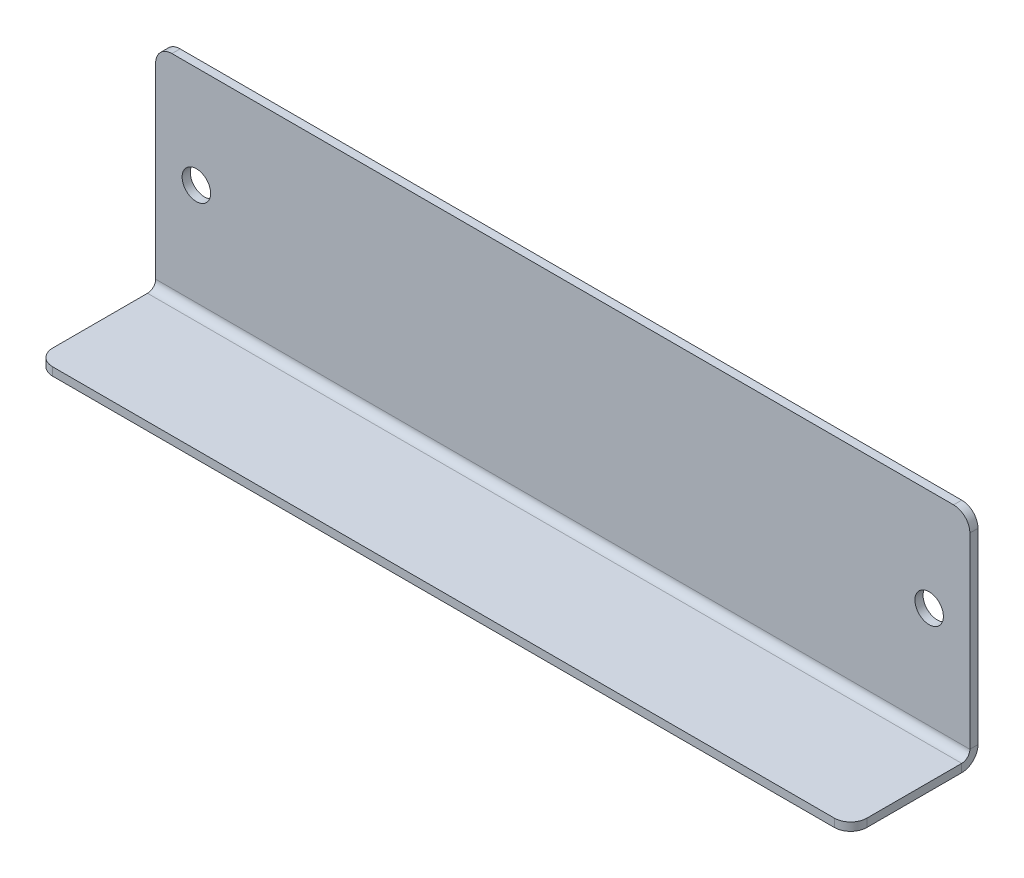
ISO-10303-21;
HEADER;
FILE_DESCRIPTION(('STEP AP214'),'2;1');
FILE_NAME('part.step','',(''),(''),'','','');
FILE_SCHEMA(('AUTOMOTIVE_DESIGN { 1 0 10303 214 1 1 1 1 }'));
ENDSEC;
DATA;
#1=APPLICATION_CONTEXT('core data for automotive mechanical design processes');
#2=APPLICATION_PROTOCOL_DEFINITION('international standard','automotive_design',2000,#1);
#3=PRODUCT_CONTEXT('',#1,'mechanical');
#4=PRODUCT('Part','Part','',(#3));
#5=PRODUCT_RELATED_PRODUCT_CATEGORY('part','',(#4));
#6=PRODUCT_DEFINITION_FORMATION('','',#4);
#7=PRODUCT_DEFINITION_CONTEXT('part definition',#1,'design');
#8=PRODUCT_DEFINITION('design','',#6,#7);
#9=PRODUCT_DEFINITION_SHAPE('','',#8);
#10=(LENGTH_UNIT() NAMED_UNIT(*) SI_UNIT(.MILLI.,.METRE.));
#11=(NAMED_UNIT(*) PLANE_ANGLE_UNIT() SI_UNIT($,.RADIAN.));
#12=(NAMED_UNIT(*) SI_UNIT($,.STERADIAN.) SOLID_ANGLE_UNIT());
#13=UNCERTAINTY_MEASURE_WITH_UNIT(LENGTH_MEASURE(1.E-05),#10,'distance_accuracy_value','');
#14=(GEOMETRIC_REPRESENTATION_CONTEXT(3) GLOBAL_UNCERTAINTY_ASSIGNED_CONTEXT((#13)) GLOBAL_UNIT_ASSIGNED_CONTEXT((#10,
#11,#12)) REPRESENTATION_CONTEXT('',''));
#15=CARTESIAN_POINT('',(0.,0.,0.));
#16=DIRECTION('',(0.,0.,1.));
#17=DIRECTION('',(1.,0.,0.));
#18=AXIS2_PLACEMENT_3D('',#15,#16,#17);
#19=CARTESIAN_POINT('',(50.,-26.9999999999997,-24.3561944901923));
#20=DIRECTION('',(1.,0.,0.));
#21=DIRECTION('',(0.,0.,-1.));
#22=AXIS2_PLACEMENT_3D('',#19,#20,#21);
#23=PLANE('',#22);
#24=DIRECTION('',(0.,0.,-1.));
#25=VECTOR('',#24,1.);
#26=CARTESIAN_POINT('',(50.,-26.9999999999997,-24.3561944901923));
#27=LINE('',#26,#25);
#28=CARTESIAN_POINT('',(50.,-26.9999999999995,12.6438055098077));
#29=VERTEX_POINT('',#28);
#30=CARTESIAN_POINT('',(50.,-26.9999999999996,1.));
#31=VERTEX_POINT('',#30);
#32=EDGE_CURVE('E254',#29,#31,#27,.T.);
#33=ORIENTED_EDGE('',*,*,#32,.T.);
#34=DIRECTION('',(0.,1.,0.));
#35=VECTOR('',#34,1.);
#36=CARTESIAN_POINT('',(50.,-26.9999999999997,1.));
#37=LINE('',#36,#35);
#38=CARTESIAN_POINT('',(50.,-25.9999999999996,1.));
#39=VERTEX_POINT('',#38);
#40=EDGE_CURVE('E14',#31,#39,#37,.T.);
#41=ORIENTED_EDGE('',*,*,#40,.T.);
#42=DIRECTION('',(0.,0.,-1.));
#43=VECTOR('',#42,1.);
#44=CARTESIAN_POINT('',(50.,-25.9999999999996,-24.3561944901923));
#45=LINE('',#44,#43);
#46=CARTESIAN_POINT('',(50.,-25.9999999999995,12.6438055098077));
#47=VERTEX_POINT('',#46);
#48=EDGE_CURVE('E77',#47,#39,#45,.T.);
#49=ORIENTED_EDGE('',*,*,#48,.F.);
#50=DIRECTION('',(0.,1.,0.));
#51=VECTOR('',#50,1.);
#52=CARTESIAN_POINT('',(50.,-26.9999999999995,12.6438055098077));
#53=LINE('',#52,#51);
#54=EDGE_CURVE('E176',#29,#47,#53,.T.);
#55=ORIENTED_EDGE('',*,*,#54,.F.);
#56=EDGE_LOOP('',(#33,#41,#49,#55));
#57=FACE_BOUND('',#56,.T.);
#58=ADVANCED_FACE('F61',(#57),#23,.T.);
#59=CARTESIAN_POINT('',(-50.0000000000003,-27.0000000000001,-24.3561944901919));
#60=DIRECTION('',(-1.,0.,0.));
#61=DIRECTION('',(0.,0.,1.));
#62=AXIS2_PLACEMENT_3D('',#59,#60,#61);
#63=PLANE('',#62);
#64=DIRECTION('',(0.,0.,1.));
#65=VECTOR('',#64,1.);
#66=CARTESIAN_POINT('',(-50.0000000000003,-26.,-24.3561944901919));
#67=LINE('',#66,#65);
#68=CARTESIAN_POINT('',(-50.0000000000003,-26.,1.00000000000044));
#69=VERTEX_POINT('',#68);
#70=CARTESIAN_POINT('',(-50.0000000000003,-25.9999999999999,12.6438055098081));
#71=VERTEX_POINT('',#70);
#72=EDGE_CURVE('E84',#69,#71,#67,.T.);
#73=ORIENTED_EDGE('',*,*,#72,.F.);
#74=DIRECTION('',(0.,-1.,0.));
#75=VECTOR('',#74,1.);
#76=CARTESIAN_POINT('',(-50.0000000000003,-27.0000000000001,1.00000000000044));
#77=LINE('',#76,#75);
#78=CARTESIAN_POINT('',(-50.0000000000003,-27.,1.00000000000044));
#79=VERTEX_POINT('',#78);
#80=EDGE_CURVE('E149',#69,#79,#77,.T.);
#81=ORIENTED_EDGE('',*,*,#80,.T.);
#82=DIRECTION('',(0.,0.,1.));
#83=VECTOR('',#82,1.);
#84=CARTESIAN_POINT('',(-50.0000000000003,-27.0000000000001,-24.3561944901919));
#85=LINE('',#84,#83);
#86=CARTESIAN_POINT('',(-50.0000000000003,-26.9999999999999,12.6438055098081));
#87=VERTEX_POINT('',#86);
#88=EDGE_CURVE('E64',#79,#87,#85,.T.);
#89=ORIENTED_EDGE('',*,*,#88,.T.);
#90=DIRECTION('',(0.,1.,0.));
#91=VECTOR('',#90,1.);
#92=CARTESIAN_POINT('',(-50.0000000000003,-26.9999999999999,12.6438055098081));
#93=LINE('',#92,#91);
#94=EDGE_CURVE('E268',#87,#71,#93,.T.);
#95=ORIENTED_EDGE('',*,*,#94,.T.);
#96=EDGE_LOOP('',(#73,#81,#89,#95));
#97=FACE_BOUND('',#96,.T.);
#98=ADVANCED_FACE('F151',(#97),#63,.T.);
#99=CARTESIAN_POINT('',(48.,-25.9999999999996,-24.3561944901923));
#100=DIRECTION('',(0.,1.,0.));
#101=DIRECTION('',(1.,0.,0.));
#102=AXIS2_PLACEMENT_3D('',#99,#100,#101);
#103=PLANE('',#102);
#104=ORIENTED_EDGE('',*,*,#48,.T.);
#105=DIRECTION('',(-1.,0.,0.));
#106=VECTOR('',#105,1.);
#107=CARTESIAN_POINT('',(48.,-25.9999999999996,1.));
#108=LINE('',#107,#106);
#109=EDGE_CURVE('E69',#39,#69,#108,.T.);
#110=ORIENTED_EDGE('',*,*,#109,.T.);
#111=ORIENTED_EDGE('',*,*,#72,.T.);
#112=CARTESIAN_POINT('',(-48.0000000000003,-25.9999999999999,12.6438055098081));
#113=DIRECTION('',(0.,1.,0.));
#114=DIRECTION('',(-1.,0.,0.));
#115=AXIS2_PLACEMENT_3D('',#112,#113,#114);
#116=CIRCLE('',#115,2.);
#117=CARTESIAN_POINT('',(-48.0000000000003,-25.9999999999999,14.6438055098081));
#118=VERTEX_POINT('',#117);
#119=EDGE_CURVE('E255',#71,#118,#116,.T.);
#120=ORIENTED_EDGE('',*,*,#119,.T.);
#121=DIRECTION('',(1.,0.,0.));
#122=VECTOR('',#121,1.);
#123=CARTESIAN_POINT('',(-48.0000000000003,-25.9999999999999,14.6438055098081));
#124=LINE('',#123,#122);
#125=CARTESIAN_POINT('',(48.,-25.9999999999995,14.6438055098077));
#126=VERTEX_POINT('',#125);
#127=EDGE_CURVE('E258',#118,#126,#124,.T.);
#128=ORIENTED_EDGE('',*,*,#127,.T.);
#129=CARTESIAN_POINT('',(48.,-25.9999999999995,12.6438055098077));
#130=DIRECTION('',(0.,1.,0.));
#131=DIRECTION('',(-1.,0.,0.));
#132=AXIS2_PLACEMENT_3D('',#129,#130,#131);
#133=CIRCLE('',#132,2.);
#134=EDGE_CURVE('E261',#126,#47,#133,.T.);
#135=ORIENTED_EDGE('',*,*,#134,.T.);
#136=EDGE_LOOP('',(#104,#110,#111,#120,#128,#135));
#137=FACE_BOUND('',#136,.T.);
#138=ADVANCED_FACE('F272',(#137),#103,.T.);
#139=CARTESIAN_POINT('',(48.,-26.9999999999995,12.6438055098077));
#140=DIRECTION('',(0.,1.,0.));
#141=DIRECTION('',(1.,0.,0.));
#142=AXIS2_PLACEMENT_3D('',#139,#140,#141);
#143=CYLINDRICAL_SURFACE('',#142,2.);
#144=ORIENTED_EDGE('',*,*,#134,.F.);
#145=DIRECTION('',(0.,1.,0.));
#146=VECTOR('',#145,1.);
#147=CARTESIAN_POINT('',(48.,-26.9999999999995,14.6438055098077));
#148=LINE('',#147,#146);
#149=CARTESIAN_POINT('',(48.,-26.9999999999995,14.6438055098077));
#150=VERTEX_POINT('',#149);
#151=EDGE_CURVE('E264',#150,#126,#148,.T.);
#152=ORIENTED_EDGE('',*,*,#151,.F.);
#153=CARTESIAN_POINT('',(48.,-26.9999999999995,12.6438055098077));
#154=DIRECTION('',(0.,1.,0.));
#155=DIRECTION('',(-1.,0.,0.));
#156=AXIS2_PLACEMENT_3D('',#153,#154,#155);
#157=CIRCLE('',#156,2.);
#158=EDGE_CURVE('E251',#150,#29,#157,.T.);
#159=ORIENTED_EDGE('',*,*,#158,.T.);
#160=ORIENTED_EDGE('',*,*,#54,.T.);
#161=EDGE_LOOP('',(#144,#152,#159,#160));
#162=FACE_BOUND('',#161,.T.);
#163=ADVANCED_FACE('F334',(#162),#143,.T.);
#164=CARTESIAN_POINT('',(-48.0000000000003,-26.9999999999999,14.6438055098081));
#165=DIRECTION('',(0.,0.,1.));
#166=DIRECTION('',(1.,0.,0.));
#167=AXIS2_PLACEMENT_3D('',#164,#165,#166);
#168=PLANE('',#167);
#169=ORIENTED_EDGE('',*,*,#127,.F.);
#170=DIRECTION('',(0.,1.,0.));
#171=VECTOR('',#170,1.);
#172=CARTESIAN_POINT('',(-48.0000000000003,-26.9999999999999,14.6438055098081));
#173=LINE('',#172,#171);
#174=CARTESIAN_POINT('',(-48.0000000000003,-26.9999999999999,14.6438055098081));
#175=VERTEX_POINT('',#174);
#176=EDGE_CURVE('E266',#175,#118,#173,.T.);
#177=ORIENTED_EDGE('',*,*,#176,.F.);
#178=DIRECTION('',(1.,0.,0.));
#179=VECTOR('',#178,1.);
#180=CARTESIAN_POINT('',(-48.0000000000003,-26.9999999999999,14.6438055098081));
#181=LINE('',#180,#179);
#182=EDGE_CURVE('E248',#175,#150,#181,.T.);
#183=ORIENTED_EDGE('',*,*,#182,.T.);
#184=ORIENTED_EDGE('',*,*,#151,.T.);
#185=EDGE_LOOP('',(#169,#177,#183,#184));
#186=FACE_BOUND('',#185,.T.);
#187=ADVANCED_FACE('F279',(#186),#168,.T.);
#188=CARTESIAN_POINT('',(-48.0000000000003,-26.9999999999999,12.6438055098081));
#189=DIRECTION('',(0.,1.,0.));
#190=DIRECTION('',(1.,0.,0.));
#191=AXIS2_PLACEMENT_3D('',#188,#189,#190);
#192=CYLINDRICAL_SURFACE('',#191,2.);
#193=ORIENTED_EDGE('',*,*,#119,.F.);
#194=ORIENTED_EDGE('',*,*,#94,.F.);
#195=CARTESIAN_POINT('',(-48.0000000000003,-26.9999999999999,12.6438055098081));
#196=DIRECTION('',(0.,1.,0.));
#197=DIRECTION('',(-1.,0.,0.));
#198=AXIS2_PLACEMENT_3D('',#195,#196,#197);
#199=CIRCLE('',#198,2.);
#200=EDGE_CURVE('E167',#87,#175,#199,.T.);
#201=ORIENTED_EDGE('',*,*,#200,.T.);
#202=ORIENTED_EDGE('',*,*,#176,.T.);
#203=EDGE_LOOP('',(#193,#194,#201,#202));
#204=FACE_BOUND('',#203,.T.);
#205=ADVANCED_FACE('F276',(#204),#192,.T.);
#206=CARTESIAN_POINT('',(48.,-26.9999999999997,-24.3561944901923));
#207=DIRECTION('',(0.,1.,0.));
#208=DIRECTION('',(1.,0.,0.));
#209=AXIS2_PLACEMENT_3D('',#206,#207,#208);
#210=PLANE('',#209);
#211=DIRECTION('',(-1.,0.,0.));
#212=VECTOR('',#211,1.);
#213=CARTESIAN_POINT('',(48.,-26.9999999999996,1.));
#214=LINE('',#213,#212);
#215=EDGE_CURVE('E157',#31,#79,#214,.T.);
#216=ORIENTED_EDGE('',*,*,#215,.F.);
#217=ORIENTED_EDGE('',*,*,#32,.F.);
#218=ORIENTED_EDGE('',*,*,#158,.F.);
#219=ORIENTED_EDGE('',*,*,#182,.F.);
#220=ORIENTED_EDGE('',*,*,#200,.F.);
#221=ORIENTED_EDGE('',*,*,#88,.F.);
#222=EDGE_LOOP('',(#216,#217,#218,#219,#220,#221));
#223=FACE_BOUND('',#222,.T.);
#224=ADVANCED_FACE('F162',(#223),#210,.F.);
#225=CARTESIAN_POINT('',(48.,-1.99999999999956,-1.));
#226=DIRECTION('',(0.,0.,1.));
#227=DIRECTION('',(1.,0.,0.));
#228=AXIS2_PLACEMENT_3D('',#225,#226,#227);
#229=CYLINDRICAL_SURFACE('',#228,2.);
#230=CARTESIAN_POINT('',(48.,-1.99999999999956,0.));
#231=DIRECTION('',(0.,0.,1.));
#232=DIRECTION('',(1.,0.,0.));
#233=AXIS2_PLACEMENT_3D('',#230,#231,#232);
#234=CIRCLE('',#233,2.);
#235=CARTESIAN_POINT('',(50.,-1.99999999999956,0.));
#236=VERTEX_POINT('',#235);
#237=CARTESIAN_POINT('',(48.,4.44089209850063E-13,0.));
#238=VERTEX_POINT('',#237);
#239=EDGE_CURVE('E207',#236,#238,#234,.T.);
#240=ORIENTED_EDGE('',*,*,#239,.F.);
#241=DIRECTION('',(0.,0.,1.));
#242=VECTOR('',#241,1.);
#243=CARTESIAN_POINT('',(50.,-1.99999999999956,-1.));
#244=LINE('',#243,#242);
#245=CARTESIAN_POINT('',(50.,-1.99999999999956,-1.));
#246=VERTEX_POINT('',#245);
#247=EDGE_CURVE('E194',#246,#236,#244,.T.);
#248=ORIENTED_EDGE('',*,*,#247,.F.);
#249=CARTESIAN_POINT('',(48.,-1.99999999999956,-1.));
#250=DIRECTION('',(0.,0.,1.));
#251=DIRECTION('',(1.,0.,0.));
#252=AXIS2_PLACEMENT_3D('',#249,#250,#251);
#253=CIRCLE('',#252,2.);
#254=CARTESIAN_POINT('',(48.,4.44089209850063E-13,-1.));
#255=VERTEX_POINT('',#254);
#256=EDGE_CURVE('E241',#246,#255,#253,.T.);
#257=ORIENTED_EDGE('',*,*,#256,.T.);
#258=DIRECTION('',(0.,0.,1.));
#259=VECTOR('',#258,1.);
#260=CARTESIAN_POINT('',(48.,4.44089209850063E-13,-1.));
#261=LINE('',#260,#259);
#262=EDGE_CURVE('E239',#255,#238,#261,.T.);
#263=ORIENTED_EDGE('',*,*,#262,.T.);
#264=EDGE_LOOP('',(#240,#248,#257,#263));
#265=FACE_BOUND('',#264,.T.);
#266=ADVANCED_FACE('F309',(#265),#229,.T.);
#267=CARTESIAN_POINT('',(-48.,0.,-0.999999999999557));
#268=DIRECTION('',(0.,1.,0.));
#269=DIRECTION('',(-1.,0.,0.));
#270=AXIS2_PLACEMENT_3D('',#267,#268,#269);
#271=PLANE('',#270);
#272=DIRECTION('',(-1.,0.,0.));
#273=VECTOR('',#272,1.);
#274=CARTESIAN_POINT('',(-48.,0.,4.44089209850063E-13));
#275=LINE('',#274,#273);
#276=CARTESIAN_POINT('',(-48.,0.,4.44089209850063E-13));
#277=VERTEX_POINT('',#276);
#278=EDGE_CURVE('E204',#238,#277,#275,.T.);
#279=ORIENTED_EDGE('',*,*,#278,.F.);
#280=ORIENTED_EDGE('',*,*,#262,.F.);
#281=DIRECTION('',(-1.,0.,0.));
#282=VECTOR('',#281,1.);
#283=CARTESIAN_POINT('',(-48.,0.,-0.999999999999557));
#284=LINE('',#283,#282);
#285=CARTESIAN_POINT('',(-48.,0.,-0.999999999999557));
#286=VERTEX_POINT('',#285);
#287=EDGE_CURVE('E236',#255,#286,#284,.T.);
#288=ORIENTED_EDGE('',*,*,#287,.T.);
#289=DIRECTION('',(0.,0.,1.));
#290=VECTOR('',#289,1.);
#291=CARTESIAN_POINT('',(-48.,0.,-0.999999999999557));
#292=LINE('',#291,#290);
#293=EDGE_CURVE('E234',#286,#277,#292,.T.);
#294=ORIENTED_EDGE('',*,*,#293,.T.);
#295=EDGE_LOOP('',(#279,#280,#288,#294));
#296=FACE_BOUND('',#295,.T.);
#297=ADVANCED_FACE('F312',(#296),#271,.T.);
#298=CARTESIAN_POINT('',(-48.,-2.,-0.999999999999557));
#299=DIRECTION('',(0.,0.,1.));
#300=DIRECTION('',(1.,0.,0.));
#301=AXIS2_PLACEMENT_3D('',#298,#299,#300);
#302=CYLINDRICAL_SURFACE('',#301,2.);
#303=CARTESIAN_POINT('',(-48.,-2.,4.44089209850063E-13));
#304=DIRECTION('',(0.,0.,1.));
#305=DIRECTION('',(1.,0.,0.));
#306=AXIS2_PLACEMENT_3D('',#303,#304,#305);
#307=CIRCLE('',#306,2.);
#308=CARTESIAN_POINT('',(-50.,-2.,4.44089209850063E-13));
#309=VERTEX_POINT('',#308);
#310=EDGE_CURVE('E201',#277,#309,#307,.T.);
#311=ORIENTED_EDGE('',*,*,#310,.F.);
#312=ORIENTED_EDGE('',*,*,#293,.F.);
#313=CARTESIAN_POINT('',(-48.,-2.,-0.999999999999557));
#314=DIRECTION('',(0.,0.,1.));
#315=DIRECTION('',(1.,0.,0.));
#316=AXIS2_PLACEMENT_3D('',#313,#314,#315);
#317=CIRCLE('',#316,2.);
#318=CARTESIAN_POINT('',(-50.,-2.,-0.999999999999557));
#319=VERTEX_POINT('',#318);
#320=EDGE_CURVE('E231',#286,#319,#317,.T.);
#321=ORIENTED_EDGE('',*,*,#320,.T.);
#322=DIRECTION('',(0.,0.,1.));
#323=VECTOR('',#322,1.);
#324=CARTESIAN_POINT('',(-50.,-2.,-0.999999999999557));
#325=LINE('',#324,#323);
#326=EDGE_CURVE('E229',#319,#309,#325,.T.);
#327=ORIENTED_EDGE('',*,*,#326,.T.);
#328=EDGE_LOOP('',(#311,#312,#321,#327));
#329=FACE_BOUND('',#328,.T.);
#330=ADVANCED_FACE('F314',(#329),#302,.T.);
#331=CARTESIAN_POINT('',(-45.,-12.5,-0.999999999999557));
#332=DIRECTION('',(0.,0.,1.));
#333=DIRECTION('',(1.,0.,0.));
#334=AXIS2_PLACEMENT_3D('',#331,#332,#333);
#335=CYLINDRICAL_SURFACE('',#334,1.75);
#336=CARTESIAN_POINT('',(-45.,-12.5,-0.999999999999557));
#337=DIRECTION('',(0.,0.,1.));
#338=DIRECTION('',(1.,0.,0.));
#339=AXIS2_PLACEMENT_3D('',#336,#337,#338);
#340=CIRCLE('',#339,1.75);
#341=CARTESIAN_POINT('',(-43.25,-12.5,-0.999999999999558));
#342=VERTEX_POINT('',#341);
#343=EDGE_CURVE('E217',#342,#342,#340,.T.);
#344=ORIENTED_EDGE('',*,*,#343,.F.);
#345=EDGE_LOOP('',(#344));
#346=FACE_BOUND('',#345,.T.);
#347=CARTESIAN_POINT('',(-45.,-12.5,4.44089209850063E-13));
#348=DIRECTION('',(0.,0.,1.));
#349=DIRECTION('',(1.,0.,0.));
#350=AXIS2_PLACEMENT_3D('',#347,#348,#349);
#351=CIRCLE('',#350,1.75);
#352=CARTESIAN_POINT('',(-43.25,-12.5,4.42860921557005E-13));
#353=VERTEX_POINT('',#352);
#354=EDGE_CURVE('E226',#353,#353,#351,.T.);
#355=ORIENTED_EDGE('',*,*,#354,.T.);
#356=EDGE_LOOP('',(#355));
#357=FACE_BOUND('',#356,.T.);
#358=ADVANCED_FACE('F316',(#346,#357),#335,.F.);
#359=CARTESIAN_POINT('',(45.,-12.4999999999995,-1.));
#360=DIRECTION('',(0.,0.,1.));
#361=DIRECTION('',(1.,0.,0.));
#362=AXIS2_PLACEMENT_3D('',#359,#360,#361);
#363=CYLINDRICAL_SURFACE('',#362,1.75);
#364=CARTESIAN_POINT('',(45.,-12.4999999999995,-1.));
#365=DIRECTION('',(0.,0.,1.));
#366=DIRECTION('',(-1.,0.,0.));
#367=AXIS2_PLACEMENT_3D('',#364,#365,#366);
#368=CIRCLE('',#367,1.75);
#369=CARTESIAN_POINT('',(43.25,-12.4999999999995,-1.));
#370=VERTEX_POINT('',#369);
#371=EDGE_CURVE('E220',#370,#370,#368,.T.);
#372=ORIENTED_EDGE('',*,*,#371,.F.);
#373=EDGE_LOOP('',(#372));
#374=FACE_BOUND('',#373,.T.);
#375=CARTESIAN_POINT('',(45.,-12.4999999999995,0.));
#376=DIRECTION('',(0.,0.,1.));
#377=DIRECTION('',(-1.,0.,0.));
#378=AXIS2_PLACEMENT_3D('',#375,#376,#377);
#379=CIRCLE('',#378,1.75);
#380=CARTESIAN_POINT('',(43.25,-12.4999999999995,0.));
#381=VERTEX_POINT('',#380);
#382=EDGE_CURVE('E223',#381,#381,#379,.T.);
#383=ORIENTED_EDGE('',*,*,#382,.T.);
#384=EDGE_LOOP('',(#383));
#385=FACE_BOUND('',#384,.T.);
#386=ADVANCED_FACE('F322',(#374,#385),#363,.F.);
#387=CARTESIAN_POINT('',(48.,-1.99999999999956,-1.));
#388=DIRECTION('',(0.,0.,1.));
#389=DIRECTION('',(1.,0.,0.));
#390=AXIS2_PLACEMENT_3D('',#387,#388,#389);
#391=PLANE('',#390);
#392=ORIENTED_EDGE('',*,*,#371,.T.);
#393=EDGE_LOOP('',(#392));
#394=FACE_BOUND('',#393,.T.);
#395=ORIENTED_EDGE('',*,*,#343,.T.);
#396=EDGE_LOOP('',(#395));
#397=FACE_BOUND('',#396,.T.);
#398=DIRECTION('',(0.,1.,0.));
#399=VECTOR('',#398,1.);
#400=CARTESIAN_POINT('',(50.,-1.99999999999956,-1.));
#401=LINE('',#400,#399);
#402=CARTESIAN_POINT('',(50.,-24.9999999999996,-1.));
#403=VERTEX_POINT('',#402);
#404=EDGE_CURVE('E197',#403,#246,#401,.T.);
#405=ORIENTED_EDGE('',*,*,#404,.F.);
#406=DIRECTION('',(-1.,0.,0.));
#407=VECTOR('',#406,1.);
#408=CARTESIAN_POINT('',(48.,-24.9999999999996,-1.));
#409=LINE('',#408,#407);
#410=CARTESIAN_POINT('',(-50.0000000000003,-25.,-0.999999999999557));
#411=VERTEX_POINT('',#410);
#412=EDGE_CURVE('E214',#403,#411,#409,.T.);
#413=ORIENTED_EDGE('',*,*,#412,.T.);
#414=DIRECTION('',(0.,-1.,0.));
#415=VECTOR('',#414,1.);
#416=CARTESIAN_POINT('',(-50.,-2.,-0.999999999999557));
#417=LINE('',#416,#415);
#418=EDGE_CURVE('E212',#319,#411,#417,.T.);
#419=ORIENTED_EDGE('',*,*,#418,.F.);
#420=ORIENTED_EDGE('',*,*,#320,.F.);
#421=ORIENTED_EDGE('',*,*,#287,.F.);
#422=ORIENTED_EDGE('',*,*,#256,.F.);
#423=EDGE_LOOP('',(#405,#413,#419,#420,#421,#422));
#424=FACE_BOUND('',#423,.T.);
#425=ADVANCED_FACE('F305',(#394,#397,#424),#391,.F.);
#426=CARTESIAN_POINT('',(-50.,-2.,-0.999999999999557));
#427=DIRECTION('',(-1.,0.,0.));
#428=DIRECTION('',(0.,-1.,0.));
#429=AXIS2_PLACEMENT_3D('',#426,#427,#428);
#430=PLANE('',#429);
#431=DIRECTION('',(0.,0.,-1.));
#432=VECTOR('',#431,1.);
#433=CARTESIAN_POINT('',(-50.0000000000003,-25.,-0.999999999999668));
#434=LINE('',#433,#432);
#435=CARTESIAN_POINT('',(-50.0000000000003,-25.,4.44089209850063E-13));
#436=VERTEX_POINT('',#435);
#437=EDGE_CURVE('E181',#436,#411,#434,.T.);
#438=ORIENTED_EDGE('',*,*,#437,.F.);
#439=DIRECTION('',(0.,-1.,0.));
#440=VECTOR('',#439,1.);
#441=CARTESIAN_POINT('',(-50.,-2.,4.44089209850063E-13));
#442=LINE('',#441,#440);
#443=EDGE_CURVE('E199',#309,#436,#442,.T.);
#444=ORIENTED_EDGE('',*,*,#443,.F.);
#445=ORIENTED_EDGE('',*,*,#326,.F.);
#446=ORIENTED_EDGE('',*,*,#418,.T.);
#447=EDGE_LOOP('',(#438,#444,#445,#446));
#448=FACE_BOUND('',#447,.T.);
#449=ADVANCED_FACE('F301',(#448),#430,.T.);
#450=CARTESIAN_POINT('',(48.,-1.99999999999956,0.));
#451=DIRECTION('',(0.,0.,1.));
#452=DIRECTION('',(1.,0.,0.));
#453=AXIS2_PLACEMENT_3D('',#450,#451,#452);
#454=PLANE('',#453);
#455=DIRECTION('',(-1.,0.,0.));
#456=VECTOR('',#455,1.);
#457=CARTESIAN_POINT('',(48.,-24.9999999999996,0.));
#458=LINE('',#457,#456);
#459=CARTESIAN_POINT('',(50.,-24.9999999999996,0.));
#460=VERTEX_POINT('',#459);
#461=EDGE_CURVE('E185',#460,#436,#458,.T.);
#462=ORIENTED_EDGE('',*,*,#461,.F.);
#463=DIRECTION('',(0.,1.,0.));
#464=VECTOR('',#463,1.);
#465=CARTESIAN_POINT('',(50.,-1.99999999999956,0.));
#466=LINE('',#465,#464);
#467=EDGE_CURVE('E210',#460,#236,#466,.T.);
#468=ORIENTED_EDGE('',*,*,#467,.T.);
#469=ORIENTED_EDGE('',*,*,#239,.T.);
#470=ORIENTED_EDGE('',*,*,#278,.T.);
#471=ORIENTED_EDGE('',*,*,#310,.T.);
#472=ORIENTED_EDGE('',*,*,#443,.T.);
#473=EDGE_LOOP('',(#462,#468,#469,#470,#471,#472));
#474=FACE_BOUND('',#473,.T.);
#475=ORIENTED_EDGE('',*,*,#382,.F.);
#476=EDGE_LOOP('',(#475));
#477=FACE_BOUND('',#476,.T.);
#478=ORIENTED_EDGE('',*,*,#354,.F.);
#479=EDGE_LOOP('',(#478));
#480=FACE_BOUND('',#479,.T.);
#481=ADVANCED_FACE('F296',(#474,#477,#480),#454,.T.);
#482=CARTESIAN_POINT('',(50.,-1.99999999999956,-1.));
#483=DIRECTION('',(1.,0.,0.));
#484=DIRECTION('',(0.,1.,0.));
#485=AXIS2_PLACEMENT_3D('',#482,#483,#484);
#486=PLANE('',#485);
#487=DIRECTION('',(0.,0.,1.));
#488=VECTOR('',#487,1.);
#489=CARTESIAN_POINT('',(50.,-24.9999999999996,-1.00000000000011));
#490=LINE('',#489,#488);
#491=EDGE_CURVE('E182',#403,#460,#490,.T.);
#492=ORIENTED_EDGE('',*,*,#491,.F.);
#493=ORIENTED_EDGE('',*,*,#404,.T.);
#494=ORIENTED_EDGE('',*,*,#247,.T.);
#495=ORIENTED_EDGE('',*,*,#467,.F.);
#496=EDGE_LOOP('',(#492,#493,#494,#495));
#497=FACE_BOUND('',#496,.T.);
#498=ADVANCED_FACE('F291',(#497),#486,.T.);
#499=CARTESIAN_POINT('',(50.,-24.9999999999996,1.));
#500=DIRECTION('',(1.,0.,0.));
#501=DIRECTION('',(0.,0.,-1.));
#502=AXIS2_PLACEMENT_3D('',#499,#500,#501);
#503=PLANE('',#502);
#504=ORIENTED_EDGE('',*,*,#491,.T.);
#505=CARTESIAN_POINT('',(50.,-24.9999999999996,1.));
#506=DIRECTION('',(-1.,0.,0.));
#507=DIRECTION('',(0.,-1.,0.));
#508=AXIS2_PLACEMENT_3D('',#505,#506,#507);
#509=CIRCLE('',#508,1.);
#510=EDGE_CURVE('E191',#460,#39,#509,.T.);
#511=ORIENTED_EDGE('',*,*,#510,.T.);
#512=ORIENTED_EDGE('',*,*,#40,.F.);
#513=CARTESIAN_POINT('',(50.,-24.9999999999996,1.));
#514=DIRECTION('',(-1.,0.,0.));
#515=DIRECTION('',(0.,0.,-1.));
#516=AXIS2_PLACEMENT_3D('',#513,#514,#515);
#517=CIRCLE('',#516,2.);
#518=EDGE_CURVE('E175',#403,#31,#517,.T.);
#519=ORIENTED_EDGE('',*,*,#518,.F.);
#520=EDGE_LOOP('',(#504,#511,#512,#519));
#521=FACE_BOUND('',#520,.T.);
#522=ADVANCED_FACE('F288',(#521),#503,.T.);
#523=CARTESIAN_POINT('',(-50.0000000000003,-25.,1.00000000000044));
#524=DIRECTION('',(-1.,0.,0.));
#525=DIRECTION('',(0.,0.,1.));
#526=AXIS2_PLACEMENT_3D('',#523,#524,#525);
#527=PLANE('',#526);
#528=ORIENTED_EDGE('',*,*,#80,.F.);
#529=CARTESIAN_POINT('',(-50.0000000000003,-25.,1.00000000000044));
#530=DIRECTION('',(-1.,0.,0.));
#531=DIRECTION('',(0.,-1.,0.));
#532=AXIS2_PLACEMENT_3D('',#529,#530,#531);
#533=CIRCLE('',#532,1.);
#534=EDGE_CURVE('E187',#69,#436,#533,.F.);
#535=ORIENTED_EDGE('',*,*,#534,.T.);
#536=ORIENTED_EDGE('',*,*,#437,.T.);
#537=CARTESIAN_POINT('',(-50.0000000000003,-25.,1.00000000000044));
#538=DIRECTION('',(1.,0.,0.));
#539=DIRECTION('',(0.,0.,1.));
#540=AXIS2_PLACEMENT_3D('',#537,#538,#539);
#541=CIRCLE('',#540,2.);
#542=EDGE_CURVE('E173',#79,#411,#541,.T.);
#543=ORIENTED_EDGE('',*,*,#542,.F.);
#544=EDGE_LOOP('',(#528,#535,#536,#543));
#545=FACE_BOUND('',#544,.T.);
#546=ADVANCED_FACE('F179',(#545),#527,.T.);
#547=CARTESIAN_POINT('',(100.032752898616,-24.9999999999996,1.));
#548=DIRECTION('',(-1.,0.,0.));
#549=DIRECTION('',(0.,-1.,0.));
#550=AXIS2_PLACEMENT_3D('',#547,#548,#549);
#551=CYLINDRICAL_SURFACE('',#550,2.);
#552=ORIENTED_EDGE('',*,*,#542,.T.);
#553=ORIENTED_EDGE('',*,*,#412,.F.);
#554=ORIENTED_EDGE('',*,*,#518,.T.);
#555=ORIENTED_EDGE('',*,*,#215,.T.);
#556=EDGE_LOOP('',(#552,#553,#554,#555));
#557=FACE_BOUND('',#556,.T.);
#558=ADVANCED_FACE('F171',(#557),#551,.T.);
#559=CARTESIAN_POINT('',(100.032752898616,-24.9999999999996,1.));
#560=DIRECTION('',(-1.,0.,0.));
#561=DIRECTION('',(0.,-1.,0.));
#562=AXIS2_PLACEMENT_3D('',#559,#560,#561);
#563=CYLINDRICAL_SURFACE('',#562,1.);
#564=ORIENTED_EDGE('',*,*,#534,.F.);
#565=ORIENTED_EDGE('',*,*,#109,.F.);
#566=ORIENTED_EDGE('',*,*,#510,.F.);
#567=ORIENTED_EDGE('',*,*,#461,.T.);
#568=EDGE_LOOP('',(#564,#565,#566,#567));
#569=FACE_BOUND('',#568,.T.);
#570=ADVANCED_FACE('F287',(#569),#563,.F.);
#571=CLOSED_SHELL('',(#58,#98,#138,#163,#187,#205,#224,#266,#297,#330,#358,#386,#425,#449,#481,
#498,#522,#546,#558,#570));
#572=MANIFOLD_SOLID_BREP('B2',#571);
#573=ADVANCED_BREP_SHAPE_REPRESENTATION('',(#18,#572),#14);
#574=SHAPE_DEFINITION_REPRESENTATION(#9,#573);
ENDSEC;
END-ISO-10303-21;
